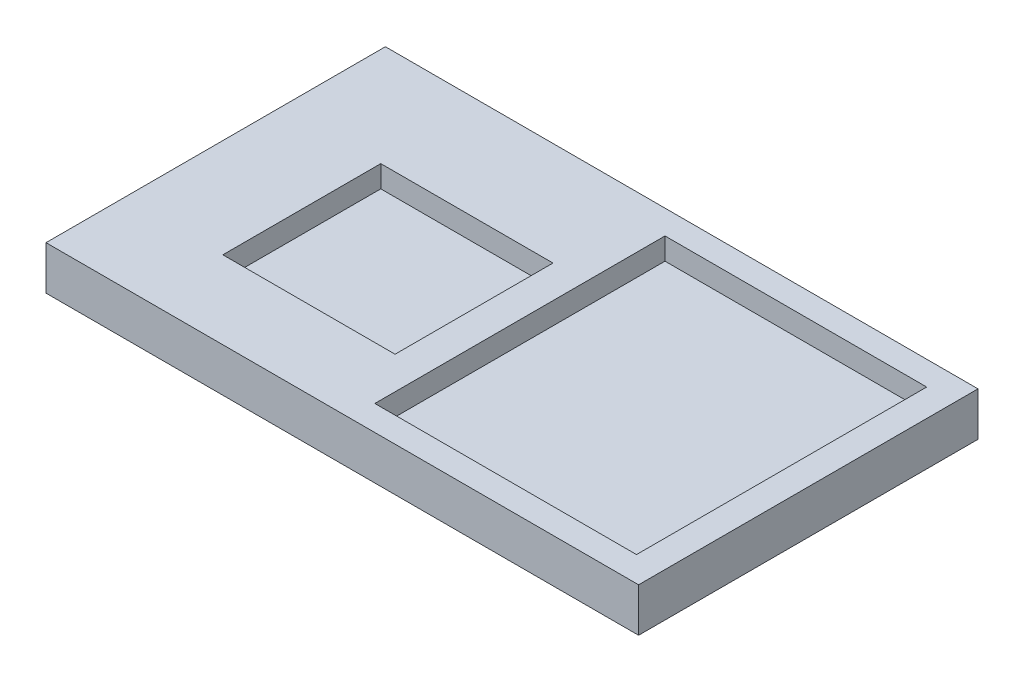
from build123d import *

# Parameters (mm, degrees)
SKETCH1_W          = 172.085363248
SKETCH1_H          = 98.560861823
EXTRUDE1_DEPTH     = 12.7
SKETCH2_W          = 50.008508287
SKETCH2_H          = 45.861995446
CUT_EXTRUDE1_DEPTH = 6.35
SKETCH3_W          = 75.992111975
SKETCH3_H          = 84.265446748
CUT_EXTRUDE2_DEPTH = 6.35


with BuildPart() as part:
    # Sketch1 → Extrude1 (new body)
    with BuildSketch(Plane(origin=(0, 0, 0), x_dir=(1, 0, 0), z_dir=(0, 1, 0))):
        with Locations((13.785844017, -0.158457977)):
            Rectangle(SKETCH1_W, SKETCH1_H)
    extrude(amount=EXTRUDE1_DEPTH)

    # Sketch2 → Cut-Extrude1 (cut)
    with BuildSketch(Plane(origin=(0, 12.7, 0), x_dir=(-1, 0, 0), z_dir=(0, 1, 0))):
        with Locations((18.521522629, 3.881964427)):
            Rectangle(SKETCH2_W, SKETCH2_H)
    extrude(amount=-CUT_EXTRUDE1_DEPTH, mode=Mode.SUBTRACT)

    # Sketch3 → Cut-Extrude2 (cut)
    with BuildSketch(Plane(origin=(0, 12.7, 0), x_dir=(-1, 0, 0), z_dir=(0, 1, 0))):
        with Locations((-53.926838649, 0.005248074)):
            Rectangle(SKETCH3_W, SKETCH3_H)
    extrude(amount=-CUT_EXTRUDE2_DEPTH, mode=Mode.SUBTRACT)


solid = part.part
